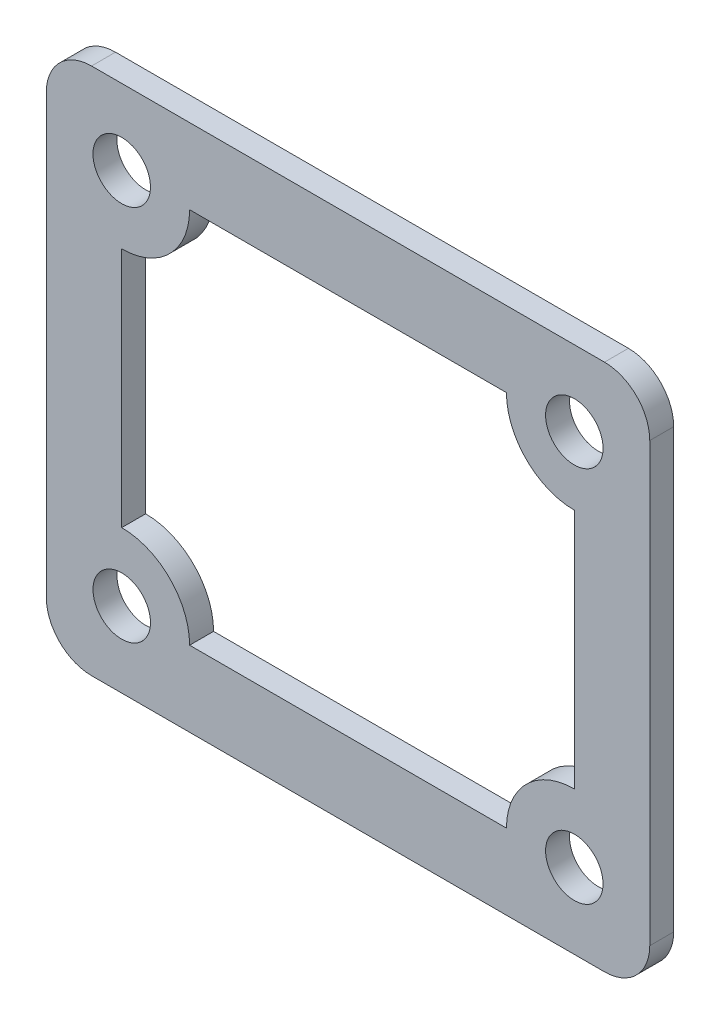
from build123d import *

# Parameters (mm, degrees)
SKETCH1_W           = 40
SKETCH1_H           = 35
SKETCH1_R           = 1.905
BOSS_EXTRUDE1_DEPTH = 1.5875
FILLET1_R           = 3


with BuildPart() as part:
    # Sketch1 → Boss-Extrude1 (new body)
    with BuildSketch(Plane.XY):
        Rectangle(SKETCH1_W, SKETCH1_H)
        with Locations((-15, -12.5)):
            Circle(SKETCH1_R, mode=Mode.SUBTRACT)
        with Locations(Location((15, -12.5, 0), (0, 0, 180))):
            Circle(SKETCH1_R, mode=Mode.SUBTRACT)
        with Locations((15, 12.5)):
            Circle(SKETCH1_R, mode=Mode.SUBTRACT)
        with Locations(Location((-15, 12.5, 0), (0, 0, 180))):
            Circle(SKETCH1_R, mode=Mode.SUBTRACT)
        with BuildLine():
            Line((-15, 8), (-15, -8))
            ThreePointArc((-15, -8), (-11.818019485, -9.318019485), (-10.5, -12.5))
            Line((-10.5, -12.5), (10.5, -12.5))
            ThreePointArc((10.5, -12.5), (11.818019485, -9.318019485), (15, -8))
            Line((15, -8), (15, 8))
            ThreePointArc((15, 8), (11.818019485, 9.318019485), (10.5, 12.5))
            Line((10.5, 12.5), (-10.5, 12.5))
            ThreePointArc((-10.5, 12.5), (-11.818019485, 9.318019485), (-15, 8))
        make_face(mode=Mode.SUBTRACT)
    extrude(amount=BOSS_EXTRUDE1_DEPTH)

    # Fillet1
    fillet1_edges = [part.edges().sort_by_distance(p)[0] for p in [
        (20, -17.5, 0.79375),
        (-20, -17.5, 0.79375),
        (-20, 17.5, 0.79375),
        (20, 17.5, 0.79375),
    ]]
    fillet(fillet1_edges, radius=FILLET1_R)


solid = part.part
